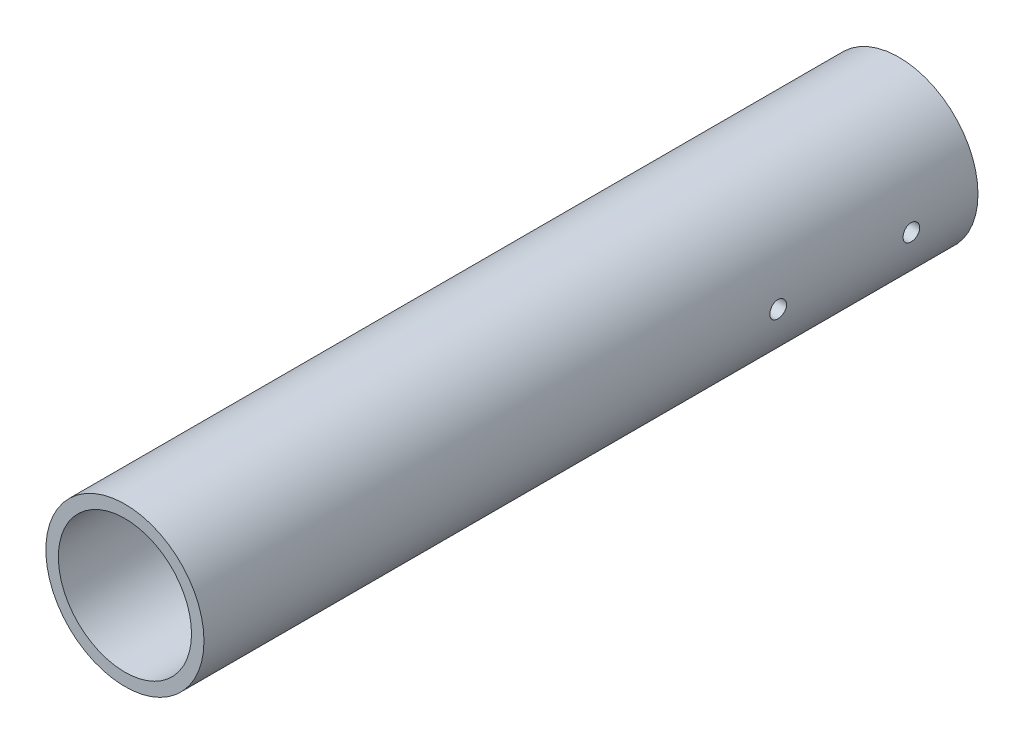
from build123d import *

# Parameters (mm, degrees)
SKETCH1_R               = 30.1625
SKETCH1_R_2             = 25.4
BOSS_EXTRUDE1_DEPTH     = 295.275
CUT_EXTRUDE1_DEPTH      = 299.340205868
CUT_EXTRUDE1_DEPTH_BACK = 299.340205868
SKETCH2_R               = 3.175


with BuildPart() as part:
    # Sketch1 → Boss-Extrude1 (new body)
    with BuildSketch(Plane.XY):
        Circle(SKETCH1_R)
        Circle(SKETCH1_R_2, mode=Mode.SUBTRACT)
    extrude(amount=BOSS_EXTRUDE1_DEPTH)

    # Sketch2 → Cut-Extrude1 (cut, two sides: drawn at the far end of the back side and taken through both)
    with BuildSketch(Plane(origin=(0, 0, 0), x_dir=(0, 0, -1), z_dir=(1, 0, 0)).offset(-CUT_EXTRUDE1_DEPTH_BACK)):
        with Locations((-76.2, 0)):
            Circle(SKETCH2_R)
        with Locations((-25.4, 0)):
            Circle(SKETCH2_R)
    extrude(amount=CUT_EXTRUDE1_DEPTH + CUT_EXTRUDE1_DEPTH_BACK, mode=Mode.SUBTRACT)


solid = part.part
